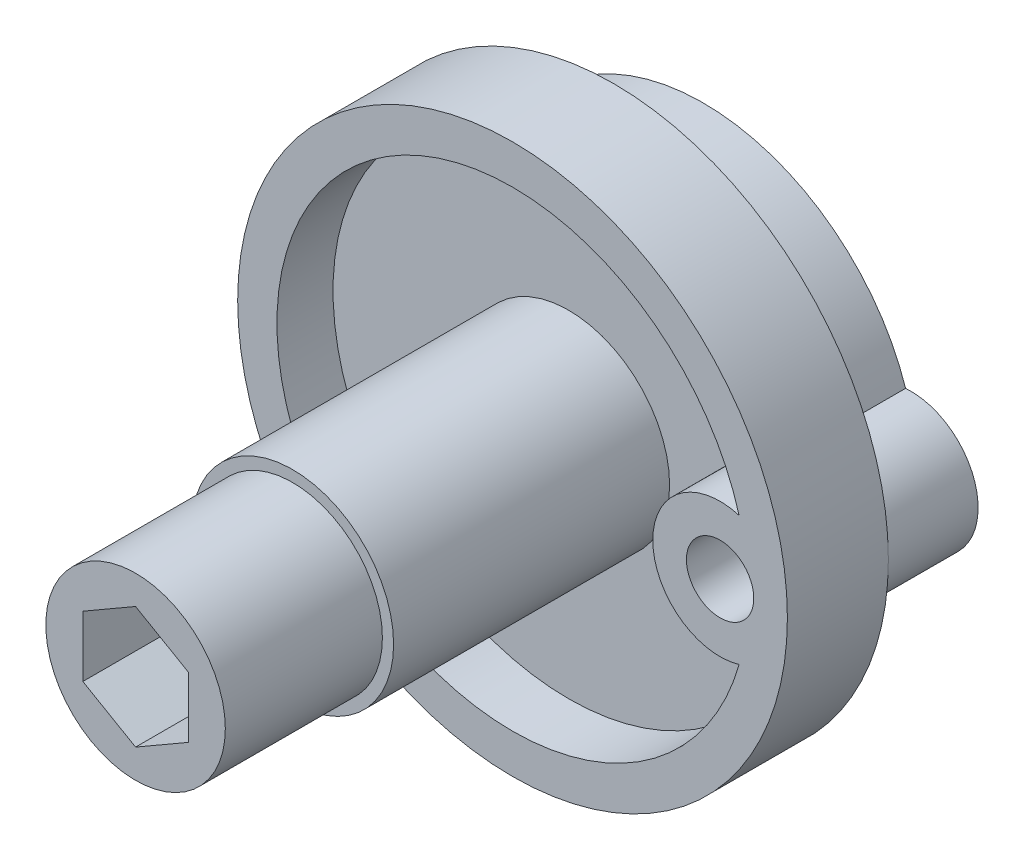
ISO-10303-21;
HEADER;
FILE_DESCRIPTION(('STEP AP214'),'2;1');
FILE_NAME('part.step','',(''),(''),'','','');
FILE_SCHEMA(('AUTOMOTIVE_DESIGN { 1 0 10303 214 1 1 1 1 }'));
ENDSEC;
DATA;
#1=APPLICATION_CONTEXT('core data for automotive mechanical design processes');
#2=APPLICATION_PROTOCOL_DEFINITION('international standard','automotive_design',2000,#1);
#3=PRODUCT_CONTEXT('',#1,'mechanical');
#4=PRODUCT('Part','Part','',(#3));
#5=PRODUCT_RELATED_PRODUCT_CATEGORY('part','',(#4));
#6=PRODUCT_DEFINITION_FORMATION('','',#4);
#7=PRODUCT_DEFINITION_CONTEXT('part definition',#1,'design');
#8=PRODUCT_DEFINITION('design','',#6,#7);
#9=PRODUCT_DEFINITION_SHAPE('','',#8);
#10=(LENGTH_UNIT() NAMED_UNIT(*) SI_UNIT(.MILLI.,.METRE.));
#11=(NAMED_UNIT(*) PLANE_ANGLE_UNIT() SI_UNIT($,.RADIAN.));
#12=(NAMED_UNIT(*) SI_UNIT($,.STERADIAN.) SOLID_ANGLE_UNIT());
#13=UNCERTAINTY_MEASURE_WITH_UNIT(LENGTH_MEASURE(1.E-05),#10,'distance_accuracy_value','');
#14=(GEOMETRIC_REPRESENTATION_CONTEXT(3) GLOBAL_UNCERTAINTY_ASSIGNED_CONTEXT((#13)) GLOBAL_UNIT_ASSIGNED_CONTEXT((#10,
#11,#12)) REPRESENTATION_CONTEXT('',''));
#15=CARTESIAN_POINT('',(0.,0.,0.));
#16=DIRECTION('',(0.,0.,1.));
#17=DIRECTION('',(1.,0.,0.));
#18=AXIS2_PLACEMENT_3D('',#15,#16,#17);
#19=CARTESIAN_POINT('',(0.,0.,0.));
#20=DIRECTION('',(0.,0.,-1.));
#21=DIRECTION('',(-1.,0.,0.));
#22=AXIS2_PLACEMENT_3D('',#19,#20,#21);
#23=PLANE('',#22);
#24=CARTESIAN_POINT('',(0.,0.,0.));
#25=DIRECTION('',(0.,0.,1.));
#26=DIRECTION('',(1.,0.,0.));
#27=AXIS2_PLACEMENT_3D('',#24,#25,#26);
#28=CIRCLE('',#27,4.);
#29=CARTESIAN_POINT('',(3.92905841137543,-0.750000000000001,0.));
#30=VERTEX_POINT('',#29);
#31=CARTESIAN_POINT('',(0.749999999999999,-3.92905841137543,0.));
#32=VERTEX_POINT('',#31);
#33=EDGE_CURVE('E125',#30,#32,#28,.F.);
#34=ORIENTED_EDGE('',*,*,#33,.F.);
#35=DIRECTION('',(1.,0.,0.));
#36=VECTOR('',#35,1.);
#37=CARTESIAN_POINT('',(3.92905841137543,-0.750000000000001,0.));
#38=LINE('',#37,#36);
#39=CARTESIAN_POINT('',(6.34526249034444,-0.750000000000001,0.));
#40=VERTEX_POINT('',#39);
#41=EDGE_CURVE('E103',#40,#30,#38,.F.);
#42=ORIENTED_EDGE('',*,*,#41,.F.);
#43=CARTESIAN_POINT('',(9.25,0.,0.));
#44=DIRECTION('',(0.,0.,-1.));
#45=DIRECTION('',(-1.,0.,0.));
#46=AXIS2_PLACEMENT_3D('',#43,#44,#45);
#47=CIRCLE('',#46,3.);
#48=CARTESIAN_POINT('',(7.59797297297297,-2.50415788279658,0.));
#49=VERTEX_POINT('',#48);
#50=EDGE_CURVE('E20',#49,#40,#47,.T.);
#51=ORIENTED_EDGE('',*,*,#50,.F.);
#52=CARTESIAN_POINT('',(0.,0.,0.));
#53=DIRECTION('',(0.,0.,1.));
#54=DIRECTION('',(1.,0.,0.));
#55=AXIS2_PLACEMENT_3D('',#52,#53,#54);
#56=CIRCLE('',#55,8.);
#57=CARTESIAN_POINT('',(0.749999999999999,-7.964766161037,0.));
#58=VERTEX_POINT('',#57);
#59=EDGE_CURVE('E100',#49,#58,#56,.F.);
#60=ORIENTED_EDGE('',*,*,#59,.T.);
#61=DIRECTION('',(0.,1.,0.));
#62=VECTOR('',#61,1.);
#63=CARTESIAN_POINT('',(0.749999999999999,-7.964766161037,0.));
#64=LINE('',#63,#62);
#65=EDGE_CURVE('E118',#32,#58,#64,.F.);
#66=ORIENTED_EDGE('',*,*,#65,.F.);
#67=EDGE_LOOP('',(#34,#42,#51,#60,#66));
#68=FACE_BOUND('',#67,.T.);
#69=ADVANCED_FACE('F16',(#68),#23,.T.);
#70=CARTESIAN_POINT('',(0.,0.,0.));
#71=DIRECTION('',(0.,0.,-1.));
#72=DIRECTION('',(-1.,0.,0.));
#73=AXIS2_PLACEMENT_3D('',#70,#71,#72);
#74=PLANE('',#73);
#75=DIRECTION('',(0.,1.,0.));
#76=VECTOR('',#75,1.);
#77=CARTESIAN_POINT('',(0.750000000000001,3.92905841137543,0.));
#78=LINE('',#77,#76);
#79=CARTESIAN_POINT('',(0.750000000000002,7.96476616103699,0.));
#80=VERTEX_POINT('',#79);
#81=CARTESIAN_POINT('',(0.750000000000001,3.92905841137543,0.));
#82=VERTEX_POINT('',#81);
#83=EDGE_CURVE('E248',#80,#82,#78,.F.);
#84=ORIENTED_EDGE('',*,*,#83,.F.);
#85=CARTESIAN_POINT('',(0.,0.,0.));
#86=DIRECTION('',(0.,0.,1.));
#87=DIRECTION('',(1.,0.,0.));
#88=AXIS2_PLACEMENT_3D('',#85,#86,#87);
#89=CIRCLE('',#88,8.);
#90=CARTESIAN_POINT('',(7.59797297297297,2.50415788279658,0.));
#91=VERTEX_POINT('',#90);
#92=EDGE_CURVE('E134',#80,#91,#89,.F.);
#93=ORIENTED_EDGE('',*,*,#92,.T.);
#94=CARTESIAN_POINT('',(9.25,0.,0.));
#95=DIRECTION('',(0.,0.,-1.));
#96=DIRECTION('',(-1.,0.,0.));
#97=AXIS2_PLACEMENT_3D('',#94,#95,#96);
#98=CIRCLE('',#97,3.);
#99=CARTESIAN_POINT('',(6.34526249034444,0.75,0.));
#100=VERTEX_POINT('',#99);
#101=EDGE_CURVE('E138',#100,#91,#98,.T.);
#102=ORIENTED_EDGE('',*,*,#101,.F.);
#103=DIRECTION('',(1.,0.,0.));
#104=VECTOR('',#103,1.);
#105=CARTESIAN_POINT('',(7.964766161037,0.75,0.));
#106=LINE('',#105,#104);
#107=CARTESIAN_POINT('',(3.92905841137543,0.75,0.));
#108=VERTEX_POINT('',#107);
#109=EDGE_CURVE('E133',#108,#100,#106,.T.);
#110=ORIENTED_EDGE('',*,*,#109,.F.);
#111=CARTESIAN_POINT('',(0.,0.,0.));
#112=DIRECTION('',(0.,0.,1.));
#113=DIRECTION('',(1.,0.,0.));
#114=AXIS2_PLACEMENT_3D('',#111,#112,#113);
#115=CIRCLE('',#114,4.);
#116=EDGE_CURVE('E129',#82,#108,#115,.F.);
#117=ORIENTED_EDGE('',*,*,#116,.F.);
#118=EDGE_LOOP('',(#84,#93,#102,#110,#117));
#119=FACE_BOUND('',#118,.T.);
#120=ADVANCED_FACE('F414',(#119),#74,.T.);
#121=CARTESIAN_POINT('',(0.,0.,0.));
#122=DIRECTION('',(0.,0.,-1.));
#123=DIRECTION('',(-1.,0.,0.));
#124=AXIS2_PLACEMENT_3D('',#121,#122,#123);
#125=PLANE('',#124);
#126=DIRECTION('',(1.,0.,0.));
#127=VECTOR('',#126,1.);
#128=CARTESIAN_POINT('',(-7.964766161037,-0.749999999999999,0.));
#129=LINE('',#128,#127);
#130=CARTESIAN_POINT('',(-3.92905841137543,-0.749999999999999,0.));
#131=VERTEX_POINT('',#130);
#132=CARTESIAN_POINT('',(-7.964766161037,-0.749999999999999,0.));
#133=VERTEX_POINT('',#132);
#134=EDGE_CURVE('E144',#131,#133,#129,.F.);
#135=ORIENTED_EDGE('',*,*,#134,.F.);
#136=CARTESIAN_POINT('',(0.,0.,0.));
#137=DIRECTION('',(0.,0.,1.));
#138=DIRECTION('',(1.,0.,0.));
#139=AXIS2_PLACEMENT_3D('',#136,#137,#138);
#140=CIRCLE('',#139,4.);
#141=CARTESIAN_POINT('',(-0.75,-3.92905841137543,0.));
#142=VERTEX_POINT('',#141);
#143=EDGE_CURVE('E145',#142,#131,#140,.F.);
#144=ORIENTED_EDGE('',*,*,#143,.F.);
#145=DIRECTION('',(0.,1.,0.));
#146=VECTOR('',#145,1.);
#147=CARTESIAN_POINT('',(-0.75,-3.92905841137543,0.));
#148=LINE('',#147,#146);
#149=CARTESIAN_POINT('',(-0.75,-7.964766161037,0.));
#150=VERTEX_POINT('',#149);
#151=EDGE_CURVE('E255',#150,#142,#148,.T.);
#152=ORIENTED_EDGE('',*,*,#151,.F.);
#153=CARTESIAN_POINT('',(0.,0.,0.));
#154=DIRECTION('',(0.,0.,1.));
#155=DIRECTION('',(1.,0.,0.));
#156=AXIS2_PLACEMENT_3D('',#153,#154,#155);
#157=CIRCLE('',#156,8.);
#158=EDGE_CURVE('E142',#150,#133,#157,.F.);
#159=ORIENTED_EDGE('',*,*,#158,.T.);
#160=EDGE_LOOP('',(#135,#144,#152,#159));
#161=FACE_BOUND('',#160,.T.);
#162=ADVANCED_FACE('F405',(#161),#125,.T.);
#163=CARTESIAN_POINT('',(0.,0.,0.));
#164=DIRECTION('',(0.,0.,-1.));
#165=DIRECTION('',(-1.,0.,0.));
#166=AXIS2_PLACEMENT_3D('',#163,#164,#165);
#167=PLANE('',#166);
#168=DIRECTION('',(1.,0.,0.));
#169=VECTOR('',#168,1.);
#170=CARTESIAN_POINT('',(-3.92905841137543,0.75,0.));
#171=LINE('',#170,#169);
#172=CARTESIAN_POINT('',(-7.964766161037,0.75,0.));
#173=VERTEX_POINT('',#172);
#174=CARTESIAN_POINT('',(-3.92905841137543,0.75,0.));
#175=VERTEX_POINT('',#174);
#176=EDGE_CURVE('E153',#173,#175,#171,.T.);
#177=ORIENTED_EDGE('',*,*,#176,.F.);
#178=CARTESIAN_POINT('',(0.,0.,0.));
#179=DIRECTION('',(0.,0.,1.));
#180=DIRECTION('',(1.,0.,0.));
#181=AXIS2_PLACEMENT_3D('',#178,#179,#180);
#182=CIRCLE('',#181,8.);
#183=CARTESIAN_POINT('',(-0.75,7.964766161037,0.));
#184=VERTEX_POINT('',#183);
#185=EDGE_CURVE('E155',#173,#184,#182,.F.);
#186=ORIENTED_EDGE('',*,*,#185,.T.);
#187=DIRECTION('',(0.,1.,0.));
#188=VECTOR('',#187,1.);
#189=CARTESIAN_POINT('',(-0.75,7.964766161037,0.));
#190=LINE('',#189,#188);
#191=CARTESIAN_POINT('',(-0.75,3.92905841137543,0.));
#192=VERTEX_POINT('',#191);
#193=EDGE_CURVE('E263',#192,#184,#190,.T.);
#194=ORIENTED_EDGE('',*,*,#193,.F.);
#195=CARTESIAN_POINT('',(0.,0.,0.));
#196=DIRECTION('',(0.,0.,1.));
#197=DIRECTION('',(1.,0.,0.));
#198=AXIS2_PLACEMENT_3D('',#195,#196,#197);
#199=CIRCLE('',#198,4.);
#200=EDGE_CURVE('E150',#175,#192,#199,.F.);
#201=ORIENTED_EDGE('',*,*,#200,.F.);
#202=EDGE_LOOP('',(#177,#186,#194,#201));
#203=FACE_BOUND('',#202,.T.);
#204=ADVANCED_FACE('F402',(#203),#167,.T.);
#205=CARTESIAN_POINT('',(9.25,0.,4.5));
#206=DIRECTION('',(0.,0.,-1.));
#207=DIRECTION('',(-1.,0.,0.));
#208=AXIS2_PLACEMENT_3D('',#205,#206,#207);
#209=CYLINDRICAL_SURFACE('',#208,3.);
#210=DIRECTION('',(0.,0.,-1.));
#211=VECTOR('',#210,1.);
#212=CARTESIAN_POINT('',(9.01689189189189,-2.99092972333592,0.));
#213=LINE('',#212,#211);
#214=CARTESIAN_POINT('',(9.01689189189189,-2.99092972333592,-4.));
#215=VERTEX_POINT('',#214);
#216=CARTESIAN_POINT('',(9.01689189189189,-2.99092972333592,0.));
#217=VERTEX_POINT('',#216);
#218=EDGE_CURVE('E107',#215,#217,#213,.F.);
#219=ORIENTED_EDGE('',*,*,#218,.F.);
#220=CARTESIAN_POINT('',(9.25,0.,-4.));
#221=DIRECTION('',(0.,0.,-1.));
#222=DIRECTION('',(-1.,0.,0.));
#223=AXIS2_PLACEMENT_3D('',#220,#221,#222);
#224=CIRCLE('',#223,3.);
#225=CARTESIAN_POINT('',(9.01689189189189,2.99092972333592,-4.));
#226=VERTEX_POINT('',#225);
#227=EDGE_CURVE('E166',#215,#226,#224,.F.);
#228=ORIENTED_EDGE('',*,*,#227,.T.);
#229=DIRECTION('',(0.,0.,-1.));
#230=VECTOR('',#229,1.);
#231=CARTESIAN_POINT('',(9.01689189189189,2.99092972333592,0.));
#232=LINE('',#231,#230);
#233=CARTESIAN_POINT('',(9.01689189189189,2.99092972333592,0.));
#234=VERTEX_POINT('',#233);
#235=EDGE_CURVE('E268',#234,#226,#232,.T.);
#236=ORIENTED_EDGE('',*,*,#235,.F.);
#237=CARTESIAN_POINT('',(9.25,0.,0.));
#238=DIRECTION('',(0.,0.,-1.));
#239=DIRECTION('',(-1.,0.,0.));
#240=AXIS2_PLACEMENT_3D('',#237,#238,#239);
#241=CIRCLE('',#240,3.);
#242=CARTESIAN_POINT('',(12.25,0.,0.));
#243=VERTEX_POINT('',#242);
#244=EDGE_CURVE('E35',#243,#234,#241,.F.);
#245=ORIENTED_EDGE('',*,*,#244,.F.);
#246=CARTESIAN_POINT('',(9.25,0.,0.));
#247=DIRECTION('',(0.,0.,-1.));
#248=DIRECTION('',(-1.,0.,0.));
#249=AXIS2_PLACEMENT_3D('',#246,#247,#248);
#250=CIRCLE('',#249,3.);
#251=EDGE_CURVE('E163',#217,#243,#250,.F.);
#252=ORIENTED_EDGE('',*,*,#251,.F.);
#253=EDGE_LOOP('',(#219,#228,#236,#245,#252));
#254=FACE_BOUND('',#253,.T.);
#255=ADVANCED_FACE('F404',(#254),#209,.T.);
#256=CARTESIAN_POINT('',(0.,0.,0.));
#257=DIRECTION('',(0.,0.,-1.));
#258=DIRECTION('',(-1.,0.,0.));
#259=AXIS2_PLACEMENT_3D('',#256,#257,#258);
#260=CYLINDRICAL_SURFACE('',#259,9.5);
#261=ORIENTED_EDGE('',*,*,#218,.T.);
#262=CARTESIAN_POINT('',(0.,0.,0.));
#263=DIRECTION('',(0.,0.,-1.));
#264=DIRECTION('',(-1.,0.,0.));
#265=AXIS2_PLACEMENT_3D('',#262,#263,#264);
#266=CIRCLE('',#265,9.5);
#267=EDGE_CURVE('E160',#234,#217,#266,.F.);
#268=ORIENTED_EDGE('',*,*,#267,.F.);
#269=ORIENTED_EDGE('',*,*,#235,.T.);
#270=CARTESIAN_POINT('',(0.,0.,-4.));
#271=DIRECTION('',(0.,0.,-1.));
#272=DIRECTION('',(-1.,0.,0.));
#273=AXIS2_PLACEMENT_3D('',#270,#271,#272);
#274=CIRCLE('',#273,9.5);
#275=EDGE_CURVE('E169',#226,#215,#274,.F.);
#276=ORIENTED_EDGE('',*,*,#275,.T.);
#277=EDGE_LOOP('',(#261,#268,#269,#276));
#278=FACE_BOUND('',#277,.T.);
#279=ADVANCED_FACE('F412',(#278),#260,.T.);
#280=CARTESIAN_POINT('',(9.25,0.,4.5));
#281=DIRECTION('',(0.,0.,-1.));
#282=DIRECTION('',(-1.,0.,0.));
#283=AXIS2_PLACEMENT_3D('',#280,#281,#282);
#284=CYLINDRICAL_SURFACE('',#283,3.);
#285=DIRECTION('',(0.,0.,1.));
#286=VECTOR('',#285,1.);
#287=CARTESIAN_POINT('',(7.59797297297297,-2.50415788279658,-4.));
#288=LINE('',#287,#286);
#289=CARTESIAN_POINT('',(7.59797297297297,-2.50415788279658,-4.));
#290=VERTEX_POINT('',#289);
#291=EDGE_CURVE('E110',#290,#49,#288,.T.);
#292=ORIENTED_EDGE('',*,*,#291,.T.);
#293=ORIENTED_EDGE('',*,*,#50,.T.);
#294=DIRECTION('',(0.,0.,-1.));
#295=VECTOR('',#294,1.);
#296=CARTESIAN_POINT('',(6.34526249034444,-0.750000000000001,0.));
#297=LINE('',#296,#295);
#298=CARTESIAN_POINT('',(6.34526249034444,-0.750000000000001,-4.));
#299=VERTEX_POINT('',#298);
#300=EDGE_CURVE('E247',#299,#40,#297,.F.);
#301=ORIENTED_EDGE('',*,*,#300,.F.);
#302=CARTESIAN_POINT('',(9.25,0.,-4.));
#303=DIRECTION('',(0.,0.,-1.));
#304=DIRECTION('',(-1.,0.,0.));
#305=AXIS2_PLACEMENT_3D('',#302,#303,#304);
#306=CIRCLE('',#305,3.);
#307=EDGE_CURVE('E114',#299,#290,#306,.F.);
#308=ORIENTED_EDGE('',*,*,#307,.T.);
#309=EDGE_LOOP('',(#292,#293,#301,#308));
#310=FACE_BOUND('',#309,.T.);
#311=ADVANCED_FACE('F111',(#310),#284,.T.);
#312=CARTESIAN_POINT('',(0.,0.,-4.));
#313=DIRECTION('',(0.,0.,1.));
#314=DIRECTION('',(1.,0.,0.));
#315=AXIS2_PLACEMENT_3D('',#312,#313,#314);
#316=CYLINDRICAL_SURFACE('',#315,8.);
#317=CARTESIAN_POINT('',(0.,0.,-4.));
#318=DIRECTION('',(0.,0.,1.));
#319=DIRECTION('',(1.,0.,0.));
#320=AXIS2_PLACEMENT_3D('',#317,#318,#319);
#321=CIRCLE('',#320,8.);
#322=CARTESIAN_POINT('',(0.749999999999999,-7.964766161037,-4.));
#323=VERTEX_POINT('',#322);
#324=EDGE_CURVE('E173',#290,#323,#321,.F.);
#325=ORIENTED_EDGE('',*,*,#324,.T.);
#326=DIRECTION('',(0.,0.,-1.));
#327=VECTOR('',#326,1.);
#328=CARTESIAN_POINT('',(0.749999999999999,-7.964766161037,0.));
#329=LINE('',#328,#327);
#330=EDGE_CURVE('E122',#58,#323,#329,.T.);
#331=ORIENTED_EDGE('',*,*,#330,.F.);
#332=ORIENTED_EDGE('',*,*,#59,.F.);
#333=ORIENTED_EDGE('',*,*,#291,.F.);
#334=EDGE_LOOP('',(#325,#331,#332,#333));
#335=FACE_BOUND('',#334,.T.);
#336=ADVANCED_FACE('F120',(#335),#316,.F.);
#337=CARTESIAN_POINT('',(0.749999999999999,-7.964766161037,0.));
#338=DIRECTION('',(1.,0.,0.));
#339=DIRECTION('',(0.,0.,-1.));
#340=AXIS2_PLACEMENT_3D('',#337,#338,#339);
#341=PLANE('',#340);
#342=ORIENTED_EDGE('',*,*,#65,.T.);
#343=ORIENTED_EDGE('',*,*,#330,.T.);
#344=DIRECTION('',(0.,1.,0.));
#345=VECTOR('',#344,1.);
#346=CARTESIAN_POINT('',(0.749999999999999,0.,-4.));
#347=LINE('',#346,#345);
#348=CARTESIAN_POINT('',(0.749999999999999,-3.92905841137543,-4.));
#349=VERTEX_POINT('',#348);
#350=EDGE_CURVE('E175',#323,#349,#347,.T.);
#351=ORIENTED_EDGE('',*,*,#350,.T.);
#352=DIRECTION('',(0.,0.,1.));
#353=VECTOR('',#352,1.);
#354=CARTESIAN_POINT('',(0.75,-3.92905841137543,-4.));
#355=LINE('',#354,#353);
#356=EDGE_CURVE('E128',#32,#349,#355,.F.);
#357=ORIENTED_EDGE('',*,*,#356,.F.);
#358=EDGE_LOOP('',(#342,#343,#351,#357));
#359=FACE_BOUND('',#358,.T.);
#360=ADVANCED_FACE('F731',(#359),#341,.T.);
#361=CARTESIAN_POINT('',(0.,0.,-4.));
#362=DIRECTION('',(0.,0.,1.));
#363=DIRECTION('',(1.,0.,0.));
#364=AXIS2_PLACEMENT_3D('',#361,#362,#363);
#365=CYLINDRICAL_SURFACE('',#364,4.);
#366=ORIENTED_EDGE('',*,*,#356,.T.);
#367=CARTESIAN_POINT('',(0.,0.,-4.));
#368=DIRECTION('',(0.,0.,1.));
#369=DIRECTION('',(1.,0.,0.));
#370=AXIS2_PLACEMENT_3D('',#367,#368,#369);
#371=CIRCLE('',#370,4.);
#372=CARTESIAN_POINT('',(3.92905841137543,-0.750000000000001,-4.));
#373=VERTEX_POINT('',#372);
#374=EDGE_CURVE('E176',#349,#373,#371,.T.);
#375=ORIENTED_EDGE('',*,*,#374,.T.);
#376=DIRECTION('',(0.,0.,-1.));
#377=VECTOR('',#376,1.);
#378=CARTESIAN_POINT('',(3.92905841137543,-0.750000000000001,0.));
#379=LINE('',#378,#377);
#380=EDGE_CURVE('E246',#30,#373,#379,.T.);
#381=ORIENTED_EDGE('',*,*,#380,.F.);
#382=ORIENTED_EDGE('',*,*,#33,.T.);
#383=EDGE_LOOP('',(#366,#375,#381,#382));
#384=FACE_BOUND('',#383,.T.);
#385=ADVANCED_FACE('F723',(#384),#365,.T.);
#386=CARTESIAN_POINT('',(3.92905841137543,-0.750000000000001,0.));
#387=DIRECTION('',(0.,-1.,0.));
#388=DIRECTION('',(0.,0.,-1.));
#389=AXIS2_PLACEMENT_3D('',#386,#387,#388);
#390=PLANE('',#389);
#391=ORIENTED_EDGE('',*,*,#380,.T.);
#392=DIRECTION('',(1.,0.,0.));
#393=VECTOR('',#392,1.);
#394=CARTESIAN_POINT('',(0.,-0.750000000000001,-4.));
#395=LINE('',#394,#393);
#396=EDGE_CURVE('E179',#373,#299,#395,.T.);
#397=ORIENTED_EDGE('',*,*,#396,.T.);
#398=ORIENTED_EDGE('',*,*,#300,.T.);
#399=ORIENTED_EDGE('',*,*,#41,.T.);
#400=EDGE_LOOP('',(#391,#397,#398,#399));
#401=FACE_BOUND('',#400,.T.);
#402=ADVANCED_FACE('F715',(#401),#390,.T.);
#403=CARTESIAN_POINT('',(7.964766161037,0.75,0.));
#404=DIRECTION('',(0.,1.,0.));
#405=DIRECTION('',(0.,0.,1.));
#406=AXIS2_PLACEMENT_3D('',#403,#404,#405);
#407=PLANE('',#406);
#408=DIRECTION('',(0.,0.,1.));
#409=VECTOR('',#408,1.);
#410=CARTESIAN_POINT('',(3.92905841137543,0.75,-4.));
#411=LINE('',#410,#409);
#412=CARTESIAN_POINT('',(3.92905841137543,0.75,-4.));
#413=VERTEX_POINT('',#412);
#414=EDGE_CURVE('E132',#108,#413,#411,.F.);
#415=ORIENTED_EDGE('',*,*,#414,.F.);
#416=ORIENTED_EDGE('',*,*,#109,.T.);
#417=DIRECTION('',(0.,0.,-1.));
#418=VECTOR('',#417,1.);
#419=CARTESIAN_POINT('',(6.34526249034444,0.750000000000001,4.5));
#420=LINE('',#419,#418);
#421=CARTESIAN_POINT('',(6.34526249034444,0.75,-4.));
#422=VERTEX_POINT('',#421);
#423=EDGE_CURVE('E136',#422,#100,#420,.F.);
#424=ORIENTED_EDGE('',*,*,#423,.F.);
#425=DIRECTION('',(1.,0.,0.));
#426=VECTOR('',#425,1.);
#427=CARTESIAN_POINT('',(0.,0.75,-4.));
#428=LINE('',#427,#426);
#429=EDGE_CURVE('E184',#422,#413,#428,.F.);
#430=ORIENTED_EDGE('',*,*,#429,.T.);
#431=EDGE_LOOP('',(#415,#416,#424,#430));
#432=FACE_BOUND('',#431,.T.);
#433=ADVANCED_FACE('F707',(#432),#407,.T.);
#434=CARTESIAN_POINT('',(0.,0.,-4.));
#435=DIRECTION('',(0.,0.,1.));
#436=DIRECTION('',(1.,0.,0.));
#437=AXIS2_PLACEMENT_3D('',#434,#435,#436);
#438=CYLINDRICAL_SURFACE('',#437,4.);
#439=ORIENTED_EDGE('',*,*,#414,.T.);
#440=CARTESIAN_POINT('',(0.,0.,-4.));
#441=DIRECTION('',(0.,0.,1.));
#442=DIRECTION('',(1.,0.,0.));
#443=AXIS2_PLACEMENT_3D('',#440,#441,#442);
#444=CIRCLE('',#443,4.);
#445=CARTESIAN_POINT('',(0.750000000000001,3.92905841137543,-4.));
#446=VERTEX_POINT('',#445);
#447=EDGE_CURVE('E180',#413,#446,#444,.T.);
#448=ORIENTED_EDGE('',*,*,#447,.T.);
#449=DIRECTION('',(0.,0.,-1.));
#450=VECTOR('',#449,1.);
#451=CARTESIAN_POINT('',(0.750000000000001,3.92905841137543,0.));
#452=LINE('',#451,#450);
#453=EDGE_CURVE('E251',#82,#446,#452,.T.);
#454=ORIENTED_EDGE('',*,*,#453,.F.);
#455=ORIENTED_EDGE('',*,*,#116,.T.);
#456=EDGE_LOOP('',(#439,#448,#454,#455));
#457=FACE_BOUND('',#456,.T.);
#458=ADVANCED_FACE('F699',(#457),#438,.T.);
#459=CARTESIAN_POINT('',(0.750000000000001,3.92905841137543,0.));
#460=DIRECTION('',(1.,0.,0.));
#461=DIRECTION('',(0.,0.,-1.));
#462=AXIS2_PLACEMENT_3D('',#459,#460,#461);
#463=PLANE('',#462);
#464=ORIENTED_EDGE('',*,*,#83,.T.);
#465=ORIENTED_EDGE('',*,*,#453,.T.);
#466=DIRECTION('',(0.,1.,0.));
#467=VECTOR('',#466,1.);
#468=CARTESIAN_POINT('',(0.750000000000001,0.,-4.));
#469=LINE('',#468,#467);
#470=CARTESIAN_POINT('',(0.750000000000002,7.96476616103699,-4.));
#471=VERTEX_POINT('',#470);
#472=EDGE_CURVE('E183',#446,#471,#469,.T.);
#473=ORIENTED_EDGE('',*,*,#472,.T.);
#474=DIRECTION('',(0.,0.,1.));
#475=VECTOR('',#474,1.);
#476=CARTESIAN_POINT('',(0.750000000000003,7.964766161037,-4.));
#477=LINE('',#476,#475);
#478=EDGE_CURVE('E137',#471,#80,#477,.T.);
#479=ORIENTED_EDGE('',*,*,#478,.T.);
#480=EDGE_LOOP('',(#464,#465,#473,#479));
#481=FACE_BOUND('',#480,.T.);
#482=ADVANCED_FACE('F691',(#481),#463,.T.);
#483=CARTESIAN_POINT('',(0.,0.,-4.));
#484=DIRECTION('',(0.,0.,1.));
#485=DIRECTION('',(1.,0.,0.));
#486=AXIS2_PLACEMENT_3D('',#483,#484,#485);
#487=CYLINDRICAL_SURFACE('',#486,8.);
#488=ORIENTED_EDGE('',*,*,#92,.F.);
#489=ORIENTED_EDGE('',*,*,#478,.F.);
#490=CARTESIAN_POINT('',(0.,0.,-4.));
#491=DIRECTION('',(0.,0.,1.));
#492=DIRECTION('',(1.,0.,0.));
#493=AXIS2_PLACEMENT_3D('',#490,#491,#492);
#494=CIRCLE('',#493,8.);
#495=CARTESIAN_POINT('',(7.59797297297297,2.50415788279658,-4.));
#496=VERTEX_POINT('',#495);
#497=EDGE_CURVE('E185',#471,#496,#494,.F.);
#498=ORIENTED_EDGE('',*,*,#497,.T.);
#499=DIRECTION('',(0.,0.,-1.));
#500=VECTOR('',#499,1.);
#501=CARTESIAN_POINT('',(7.59797297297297,2.50415788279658,4.5));
#502=LINE('',#501,#500);
#503=EDGE_CURVE('E141',#91,#496,#502,.T.);
#504=ORIENTED_EDGE('',*,*,#503,.F.);
#505=EDGE_LOOP('',(#488,#489,#498,#504));
#506=FACE_BOUND('',#505,.T.);
#507=ADVANCED_FACE('F683',(#506),#487,.F.);
#508=CARTESIAN_POINT('',(9.25,0.,4.5));
#509=DIRECTION('',(0.,0.,-1.));
#510=DIRECTION('',(-1.,0.,0.));
#511=AXIS2_PLACEMENT_3D('',#508,#509,#510);
#512=CYLINDRICAL_SURFACE('',#511,3.);
#513=ORIENTED_EDGE('',*,*,#503,.T.);
#514=CARTESIAN_POINT('',(9.25,0.,-4.));
#515=DIRECTION('',(0.,0.,-1.));
#516=DIRECTION('',(-1.,0.,0.));
#517=AXIS2_PLACEMENT_3D('',#514,#515,#516);
#518=CIRCLE('',#517,3.);
#519=EDGE_CURVE('E188',#496,#422,#518,.F.);
#520=ORIENTED_EDGE('',*,*,#519,.T.);
#521=ORIENTED_EDGE('',*,*,#423,.T.);
#522=ORIENTED_EDGE('',*,*,#101,.T.);
#523=EDGE_LOOP('',(#513,#520,#521,#522));
#524=FACE_BOUND('',#523,.T.);
#525=ADVANCED_FACE('F675',(#524),#512,.T.);
#526=CARTESIAN_POINT('',(0.,0.,-4.));
#527=DIRECTION('',(0.,0.,1.));
#528=DIRECTION('',(1.,0.,0.));
#529=AXIS2_PLACEMENT_3D('',#526,#527,#528);
#530=CYLINDRICAL_SURFACE('',#529,8.);
#531=CARTESIAN_POINT('',(0.,0.,-4.));
#532=DIRECTION('',(0.,0.,1.));
#533=DIRECTION('',(1.,0.,0.));
#534=AXIS2_PLACEMENT_3D('',#531,#532,#533);
#535=CIRCLE('',#534,8.);
#536=CARTESIAN_POINT('',(-0.75,-7.964766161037,-4.));
#537=VERTEX_POINT('',#536);
#538=CARTESIAN_POINT('',(-7.964766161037,-0.749999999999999,-4.));
#539=VERTEX_POINT('',#538);
#540=EDGE_CURVE('E191',#537,#539,#535,.F.);
#541=ORIENTED_EDGE('',*,*,#540,.T.);
#542=DIRECTION('',(0.,0.,-1.));
#543=VECTOR('',#542,1.);
#544=CARTESIAN_POINT('',(-7.964766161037,-0.749999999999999,0.));
#545=LINE('',#544,#543);
#546=EDGE_CURVE('E149',#133,#539,#545,.T.);
#547=ORIENTED_EDGE('',*,*,#546,.F.);
#548=ORIENTED_EDGE('',*,*,#158,.F.);
#549=DIRECTION('',(0.,0.,1.));
#550=VECTOR('',#549,1.);
#551=CARTESIAN_POINT('',(-0.75,-7.964766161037,0.));
#552=LINE('',#551,#550);
#553=EDGE_CURVE('E259',#537,#150,#552,.T.);
#554=ORIENTED_EDGE('',*,*,#553,.F.);
#555=EDGE_LOOP('',(#541,#547,#548,#554));
#556=FACE_BOUND('',#555,.T.);
#557=ADVANCED_FACE('F667',(#556),#530,.F.);
#558=CARTESIAN_POINT('',(-7.964766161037,-0.749999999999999,0.));
#559=DIRECTION('',(0.,-1.,0.));
#560=DIRECTION('',(0.,0.,-1.));
#561=AXIS2_PLACEMENT_3D('',#558,#559,#560);
#562=PLANE('',#561);
#563=ORIENTED_EDGE('',*,*,#134,.T.);
#564=ORIENTED_EDGE('',*,*,#546,.T.);
#565=DIRECTION('',(1.,0.,0.));
#566=VECTOR('',#565,1.);
#567=CARTESIAN_POINT('',(0.,-0.749999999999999,-4.));
#568=LINE('',#567,#566);
#569=CARTESIAN_POINT('',(-3.92905841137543,-0.749999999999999,-4.));
#570=VERTEX_POINT('',#569);
#571=EDGE_CURVE('E194',#539,#570,#568,.T.);
#572=ORIENTED_EDGE('',*,*,#571,.T.);
#573=DIRECTION('',(0.,0.,1.));
#574=VECTOR('',#573,1.);
#575=CARTESIAN_POINT('',(-3.92905841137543,-0.749999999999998,-4.));
#576=LINE('',#575,#574);
#577=EDGE_CURVE('E148',#131,#570,#576,.F.);
#578=ORIENTED_EDGE('',*,*,#577,.F.);
#579=EDGE_LOOP('',(#563,#564,#572,#578));
#580=FACE_BOUND('',#579,.T.);
#581=ADVANCED_FACE('F659',(#580),#562,.T.);
#582=CARTESIAN_POINT('',(0.,0.,-4.));
#583=DIRECTION('',(0.,0.,1.));
#584=DIRECTION('',(1.,0.,0.));
#585=AXIS2_PLACEMENT_3D('',#582,#583,#584);
#586=CYLINDRICAL_SURFACE('',#585,4.);
#587=ORIENTED_EDGE('',*,*,#577,.T.);
#588=CARTESIAN_POINT('',(0.,0.,-4.));
#589=DIRECTION('',(0.,0.,1.));
#590=DIRECTION('',(1.,0.,0.));
#591=AXIS2_PLACEMENT_3D('',#588,#589,#590);
#592=CIRCLE('',#591,4.);
#593=CARTESIAN_POINT('',(-0.75,-3.92905841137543,-4.));
#594=VERTEX_POINT('',#593);
#595=EDGE_CURVE('E195',#570,#594,#592,.T.);
#596=ORIENTED_EDGE('',*,*,#595,.T.);
#597=DIRECTION('',(0.,0.,1.));
#598=VECTOR('',#597,1.);
#599=CARTESIAN_POINT('',(-0.75,-3.92905841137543,0.));
#600=LINE('',#599,#598);
#601=EDGE_CURVE('E258',#142,#594,#600,.F.);
#602=ORIENTED_EDGE('',*,*,#601,.F.);
#603=ORIENTED_EDGE('',*,*,#143,.T.);
#604=EDGE_LOOP('',(#587,#596,#602,#603));
#605=FACE_BOUND('',#604,.T.);
#606=ADVANCED_FACE('F651',(#605),#586,.T.);
#607=CARTESIAN_POINT('',(-0.75,-3.92905841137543,0.));
#608=DIRECTION('',(-1.,0.,0.));
#609=DIRECTION('',(0.,0.,1.));
#610=AXIS2_PLACEMENT_3D('',#607,#608,#609);
#611=PLANE('',#610);
#612=ORIENTED_EDGE('',*,*,#151,.T.);
#613=ORIENTED_EDGE('',*,*,#601,.T.);
#614=DIRECTION('',(0.,1.,0.));
#615=VECTOR('',#614,1.);
#616=CARTESIAN_POINT('',(-0.75,0.,-4.));
#617=LINE('',#616,#615);
#618=EDGE_CURVE('E198',#594,#537,#617,.F.);
#619=ORIENTED_EDGE('',*,*,#618,.T.);
#620=ORIENTED_EDGE('',*,*,#553,.T.);
#621=EDGE_LOOP('',(#612,#613,#619,#620));
#622=FACE_BOUND('',#621,.T.);
#623=ADVANCED_FACE('F644',(#622),#611,.T.);
#624=CARTESIAN_POINT('',(-0.75,7.964766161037,0.));
#625=DIRECTION('',(-1.,0.,0.));
#626=DIRECTION('',(0.,0.,1.));
#627=AXIS2_PLACEMENT_3D('',#624,#625,#626);
#628=PLANE('',#627);
#629=ORIENTED_EDGE('',*,*,#193,.T.);
#630=DIRECTION('',(0.,0.,1.));
#631=VECTOR('',#630,1.);
#632=CARTESIAN_POINT('',(-0.75,7.964766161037,-4.));
#633=LINE('',#632,#631);
#634=CARTESIAN_POINT('',(-0.75,7.964766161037,-4.));
#635=VERTEX_POINT('',#634);
#636=EDGE_CURVE('E157',#184,#635,#633,.F.);
#637=ORIENTED_EDGE('',*,*,#636,.T.);
#638=DIRECTION('',(0.,1.,0.));
#639=VECTOR('',#638,1.);
#640=CARTESIAN_POINT('',(-0.75,0.,-4.));
#641=LINE('',#640,#639);
#642=CARTESIAN_POINT('',(-0.75,3.92905841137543,-4.));
#643=VERTEX_POINT('',#642);
#644=EDGE_CURVE('E203',#635,#643,#641,.F.);
#645=ORIENTED_EDGE('',*,*,#644,.T.);
#646=DIRECTION('',(0.,0.,1.));
#647=VECTOR('',#646,1.);
#648=CARTESIAN_POINT('',(-0.749999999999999,3.92905841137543,-4.));
#649=LINE('',#648,#647);
#650=EDGE_CURVE('E154',#192,#643,#649,.F.);
#651=ORIENTED_EDGE('',*,*,#650,.F.);
#652=EDGE_LOOP('',(#629,#637,#645,#651));
#653=FACE_BOUND('',#652,.T.);
#654=ADVANCED_FACE('F397',(#653),#628,.T.);
#655=CARTESIAN_POINT('',(0.,0.,-4.));
#656=DIRECTION('',(0.,0.,1.));
#657=DIRECTION('',(1.,0.,0.));
#658=AXIS2_PLACEMENT_3D('',#655,#656,#657);
#659=CYLINDRICAL_SURFACE('',#658,4.);
#660=DIRECTION('',(0.,0.,1.));
#661=VECTOR('',#660,1.);
#662=CARTESIAN_POINT('',(-3.92905841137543,0.75,0.));
#663=LINE('',#662,#661);
#664=CARTESIAN_POINT('',(-3.92905841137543,0.75,-4.));
#665=VERTEX_POINT('',#664);
#666=EDGE_CURVE('E262',#175,#665,#663,.F.);
#667=ORIENTED_EDGE('',*,*,#666,.F.);
#668=ORIENTED_EDGE('',*,*,#200,.T.);
#669=ORIENTED_EDGE('',*,*,#650,.T.);
#670=CARTESIAN_POINT('',(0.,0.,-4.));
#671=DIRECTION('',(0.,0.,1.));
#672=DIRECTION('',(1.,0.,0.));
#673=AXIS2_PLACEMENT_3D('',#670,#671,#672);
#674=CIRCLE('',#673,4.);
#675=EDGE_CURVE('E199',#643,#665,#674,.T.);
#676=ORIENTED_EDGE('',*,*,#675,.T.);
#677=EDGE_LOOP('',(#667,#668,#669,#676));
#678=FACE_BOUND('',#677,.T.);
#679=ADVANCED_FACE('F400',(#678),#659,.T.);
#680=CARTESIAN_POINT('',(-3.92905841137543,0.75,0.));
#681=DIRECTION('',(0.,1.,0.));
#682=DIRECTION('',(0.,0.,1.));
#683=AXIS2_PLACEMENT_3D('',#680,#681,#682);
#684=PLANE('',#683);
#685=ORIENTED_EDGE('',*,*,#176,.T.);
#686=ORIENTED_EDGE('',*,*,#666,.T.);
#687=DIRECTION('',(1.,0.,0.));
#688=VECTOR('',#687,1.);
#689=CARTESIAN_POINT('',(0.,0.75,-4.));
#690=LINE('',#689,#688);
#691=CARTESIAN_POINT('',(-7.964766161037,0.75,-4.));
#692=VERTEX_POINT('',#691);
#693=EDGE_CURVE('E202',#665,#692,#690,.F.);
#694=ORIENTED_EDGE('',*,*,#693,.T.);
#695=DIRECTION('',(0.,0.,1.));
#696=VECTOR('',#695,1.);
#697=CARTESIAN_POINT('',(-7.964766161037,0.749999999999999,-4.));
#698=LINE('',#697,#696);
#699=EDGE_CURVE('E158',#692,#173,#698,.T.);
#700=ORIENTED_EDGE('',*,*,#699,.T.);
#701=EDGE_LOOP('',(#685,#686,#694,#700));
#702=FACE_BOUND('',#701,.T.);
#703=ADVANCED_FACE('F376',(#702),#684,.T.);
#704=CARTESIAN_POINT('',(0.,0.,-4.));
#705=DIRECTION('',(0.,0.,1.));
#706=DIRECTION('',(1.,0.,0.));
#707=AXIS2_PLACEMENT_3D('',#704,#705,#706);
#708=CYLINDRICAL_SURFACE('',#707,8.);
#709=ORIENTED_EDGE('',*,*,#185,.F.);
#710=ORIENTED_EDGE('',*,*,#699,.F.);
#711=CARTESIAN_POINT('',(0.,0.,-4.));
#712=DIRECTION('',(0.,0.,1.));
#713=DIRECTION('',(1.,0.,0.));
#714=AXIS2_PLACEMENT_3D('',#711,#712,#713);
#715=CIRCLE('',#714,8.);
#716=EDGE_CURVE('E204',#692,#635,#715,.F.);
#717=ORIENTED_EDGE('',*,*,#716,.T.);
#718=ORIENTED_EDGE('',*,*,#636,.F.);
#719=EDGE_LOOP('',(#709,#710,#717,#718));
#720=FACE_BOUND('',#719,.T.);
#721=ADVANCED_FACE('F386',(#720),#708,.F.);
#722=CARTESIAN_POINT('',(0.,0.,0.));
#723=DIRECTION('',(0.,0.,-1.));
#724=DIRECTION('',(-1.,0.,0.));
#725=AXIS2_PLACEMENT_3D('',#722,#723,#724);
#726=PLANE('',#725);
#727=ORIENTED_EDGE('',*,*,#251,.T.);
#728=CARTESIAN_POINT('',(0.,0.,0.));
#729=DIRECTION('',(0.,0.,1.));
#730=DIRECTION('',(1.,0.,0.));
#731=AXIS2_PLACEMENT_3D('',#728,#729,#730);
#732=CIRCLE('',#731,12.25);
#733=EDGE_CURVE('E207',#243,#243,#732,.T.);
#734=ORIENTED_EDGE('',*,*,#733,.F.);
#735=ORIENTED_EDGE('',*,*,#244,.T.);
#736=ORIENTED_EDGE('',*,*,#267,.T.);
#737=EDGE_LOOP('',(#727,#734,#735,#736));
#738=FACE_BOUND('',#737,.T.);
#739=ADVANCED_FACE('F492',(#738),#726,.T.);
#740=CARTESIAN_POINT('',(0.,0.,-4.));
#741=DIRECTION('',(0.,0.,1.));
#742=DIRECTION('',(1.,0.,0.));
#743=AXIS2_PLACEMENT_3D('',#740,#741,#742);
#744=PLANE('',#743);
#745=ORIENTED_EDGE('',*,*,#693,.F.);
#746=ORIENTED_EDGE('',*,*,#675,.F.);
#747=ORIENTED_EDGE('',*,*,#644,.F.);
#748=ORIENTED_EDGE('',*,*,#716,.F.);
#749=EDGE_LOOP('',(#745,#746,#747,#748));
#750=FACE_BOUND('',#749,.T.);
#751=ORIENTED_EDGE('',*,*,#595,.F.);
#752=ORIENTED_EDGE('',*,*,#571,.F.);
#753=ORIENTED_EDGE('',*,*,#540,.F.);
#754=ORIENTED_EDGE('',*,*,#618,.F.);
#755=EDGE_LOOP('',(#751,#752,#753,#754));
#756=FACE_BOUND('',#755,.T.);
#757=DIRECTION('',(-0.866025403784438,-0.5,0.));
#758=VECTOR('',#757,1.);
#759=CARTESIAN_POINT('',(0.,2.71354626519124,-4.));
#760=LINE('',#759,#758);
#761=CARTESIAN_POINT('',(0.,2.71354626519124,-4.));
#762=VERTEX_POINT('',#761);
#763=CARTESIAN_POINT('',(-2.35,1.35677313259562,-4.));
#764=VERTEX_POINT('',#763);
#765=EDGE_CURVE('E347',#762,#764,#760,.T.);
#766=ORIENTED_EDGE('',*,*,#765,.T.);
#767=DIRECTION('',(0.,1.,0.));
#768=VECTOR('',#767,1.);
#769=CARTESIAN_POINT('',(-2.35,1.35677313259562,-4.));
#770=LINE('',#769,#768);
#771=CARTESIAN_POINT('',(-2.35,-1.35677313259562,-4.));
#772=VERTEX_POINT('',#771);
#773=EDGE_CURVE('E341',#764,#772,#770,.F.);
#774=ORIENTED_EDGE('',*,*,#773,.T.);
#775=DIRECTION('',(0.866025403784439,-0.5,0.));
#776=VECTOR('',#775,1.);
#777=CARTESIAN_POINT('',(-2.35,-1.35677313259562,-4.00000000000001));
#778=LINE('',#777,#776);
#779=CARTESIAN_POINT('',(0.,-2.71354626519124,-4.));
#780=VERTEX_POINT('',#779);
#781=EDGE_CURVE('E335',#772,#780,#778,.T.);
#782=ORIENTED_EDGE('',*,*,#781,.T.);
#783=DIRECTION('',(0.866025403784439,0.5,0.));
#784=VECTOR('',#783,1.);
#785=CARTESIAN_POINT('',(0.,-2.71354626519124,-4.00000000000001));
#786=LINE('',#785,#784);
#787=CARTESIAN_POINT('',(2.35,-1.35677313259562,-4.));
#788=VERTEX_POINT('',#787);
#789=EDGE_CURVE('E327',#780,#788,#786,.T.);
#790=ORIENTED_EDGE('',*,*,#789,.T.);
#791=DIRECTION('',(0.,1.,0.));
#792=VECTOR('',#791,1.);
#793=CARTESIAN_POINT('',(2.35,-1.35677313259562,-4.));
#794=LINE('',#793,#792);
#795=CARTESIAN_POINT('',(2.35,1.35677313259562,-4.));
#796=VERTEX_POINT('',#795);
#797=EDGE_CURVE('E218',#788,#796,#794,.T.);
#798=ORIENTED_EDGE('',*,*,#797,.T.);
#799=DIRECTION('',(-0.866025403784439,0.5,0.));
#800=VECTOR('',#799,1.);
#801=CARTESIAN_POINT('',(2.35,1.35677313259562,-4.00000000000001));
#802=LINE('',#801,#800);
#803=EDGE_CURVE('E213',#796,#762,#802,.T.);
#804=ORIENTED_EDGE('',*,*,#803,.T.);
#805=EDGE_LOOP('',(#766,#774,#782,#790,#798,#804));
#806=FACE_BOUND('',#805,.T.);
#807=ORIENTED_EDGE('',*,*,#497,.F.);
#808=ORIENTED_EDGE('',*,*,#472,.F.);
#809=ORIENTED_EDGE('',*,*,#447,.F.);
#810=ORIENTED_EDGE('',*,*,#429,.F.);
#811=ORIENTED_EDGE('',*,*,#519,.F.);
#812=EDGE_LOOP('',(#807,#808,#809,#810,#811));
#813=FACE_BOUND('',#812,.T.);
#814=ORIENTED_EDGE('',*,*,#374,.F.);
#815=ORIENTED_EDGE('',*,*,#350,.F.);
#816=ORIENTED_EDGE('',*,*,#324,.F.);
#817=ORIENTED_EDGE('',*,*,#307,.F.);
#818=ORIENTED_EDGE('',*,*,#396,.F.);
#819=EDGE_LOOP('',(#814,#815,#816,#817,#818));
#820=FACE_BOUND('',#819,.T.);
#821=CARTESIAN_POINT('',(9.25,0.,-4.));
#822=DIRECTION('',(0.,0.,-1.));
#823=DIRECTION('',(-1.,0.,0.));
#824=AXIS2_PLACEMENT_3D('',#821,#822,#823);
#825=CIRCLE('',#824,1.5);
#826=CARTESIAN_POINT('',(7.75,0.,-4.));
#827=VERTEX_POINT('',#826);
#828=EDGE_CURVE('E210',#827,#827,#825,.F.);
#829=ORIENTED_EDGE('',*,*,#828,.T.);
#830=EDGE_LOOP('',(#829));
#831=FACE_BOUND('',#830,.T.);
#832=ORIENTED_EDGE('',*,*,#227,.F.);
#833=ORIENTED_EDGE('',*,*,#275,.F.);
#834=EDGE_LOOP('',(#832,#833));
#835=FACE_BOUND('',#834,.T.);
#836=ADVANCED_FACE('F390',(#750,#756,#806,#813,#820,#831,#835),#744,.F.);
#837=CARTESIAN_POINT('',(0.,0.,0.));
#838=DIRECTION('',(0.,0.,1.));
#839=DIRECTION('',(1.,0.,0.));
#840=AXIS2_PLACEMENT_3D('',#837,#838,#839);
#841=CYLINDRICAL_SURFACE('',#840,12.25);
#842=CARTESIAN_POINT('',(0.,0.,4.5));
#843=DIRECTION('',(0.,0.,1.));
#844=DIRECTION('',(1.,0.,0.));
#845=AXIS2_PLACEMENT_3D('',#842,#843,#844);
#846=CIRCLE('',#845,12.25);
#847=CARTESIAN_POINT('',(12.25,0.,4.5));
#848=VERTEX_POINT('',#847);
#849=EDGE_CURVE('E214',#848,#848,#846,.F.);
#850=ORIENTED_EDGE('',*,*,#849,.T.);
#851=EDGE_LOOP('',(#850));
#852=FACE_BOUND('',#851,.T.);
#853=ORIENTED_EDGE('',*,*,#733,.T.);
#854=EDGE_LOOP('',(#853));
#855=FACE_BOUND('',#854,.T.);
#856=ADVANCED_FACE('F491',(#852,#855),#841,.T.);
#857=CARTESIAN_POINT('',(9.25,0.,4.5));
#858=DIRECTION('',(0.,0.,-1.));
#859=DIRECTION('',(-1.,0.,0.));
#860=AXIS2_PLACEMENT_3D('',#857,#858,#859);
#861=CYLINDRICAL_SURFACE('',#860,1.5);
#862=CARTESIAN_POINT('',(9.25,0.,4.5));
#863=DIRECTION('',(0.,0.,-1.));
#864=DIRECTION('',(-1.,0.,0.));
#865=AXIS2_PLACEMENT_3D('',#862,#863,#864);
#866=CIRCLE('',#865,1.5);
#867=CARTESIAN_POINT('',(7.75,0.,4.5));
#868=VERTEX_POINT('',#867);
#869=EDGE_CURVE('E217',#868,#868,#866,.F.);
#870=ORIENTED_EDGE('',*,*,#869,.T.);
#871=EDGE_LOOP('',(#870));
#872=FACE_BOUND('',#871,.T.);
#873=ORIENTED_EDGE('',*,*,#828,.F.);
#874=EDGE_LOOP('',(#873));
#875=FACE_BOUND('',#874,.T.);
#876=ADVANCED_FACE('F498',(#872,#875),#861,.F.);
#877=CARTESIAN_POINT('',(2.35,1.35677313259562,14.3));
#878=DIRECTION('',(0.5,0.866025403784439,0.));
#879=DIRECTION('',(-0.866025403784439,0.5,0.));
#880=AXIS2_PLACEMENT_3D('',#877,#878,#879);
#881=PLANE('',#880);
#882=DIRECTION('',(0.,0.,-1.));
#883=VECTOR('',#882,1.);
#884=CARTESIAN_POINT('',(2.35,1.35677313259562,14.3));
#885=LINE('',#884,#883);
#886=CARTESIAN_POINT('',(2.35,1.35677313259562,21.3));
#887=VERTEX_POINT('',#886);
#888=EDGE_CURVE('E323',#796,#887,#885,.F.);
#889=ORIENTED_EDGE('',*,*,#888,.T.);
#890=DIRECTION('',(-0.866025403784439,0.5,0.));
#891=VECTOR('',#890,1.);
#892=CARTESIAN_POINT('',(2.35,1.35677313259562,21.3));
#893=LINE('',#892,#891);
#894=CARTESIAN_POINT('',(0.,2.71354626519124,21.3));
#895=VERTEX_POINT('',#894);
#896=EDGE_CURVE('E221',#887,#895,#893,.T.);
#897=ORIENTED_EDGE('',*,*,#896,.T.);
#898=DIRECTION('',(0.,0.,1.));
#899=VECTOR('',#898,1.);
#900=CARTESIAN_POINT('',(0.,2.71354626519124,14.3));
#901=LINE('',#900,#899);
#902=EDGE_CURVE('E350',#895,#762,#901,.F.);
#903=ORIENTED_EDGE('',*,*,#902,.T.);
#904=ORIENTED_EDGE('',*,*,#803,.F.);
#905=EDGE_LOOP('',(#889,#897,#903,#904));
#906=FACE_BOUND('',#905,.T.);
#907=ADVANCED_FACE('F507',(#906),#881,.F.);
#908=CARTESIAN_POINT('',(0.,2.71354626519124,14.3));
#909=DIRECTION('',(-0.5,0.866025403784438,0.));
#910=DIRECTION('',(-0.866025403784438,-0.5,0.));
#911=AXIS2_PLACEMENT_3D('',#908,#909,#910);
#912=PLANE('',#911);
#913=ORIENTED_EDGE('',*,*,#902,.F.);
#914=DIRECTION('',(-0.866025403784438,-0.5,0.));
#915=VECTOR('',#914,1.);
#916=CARTESIAN_POINT('',(0.,2.71354626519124,21.3));
#917=LINE('',#916,#915);
#918=CARTESIAN_POINT('',(-2.35,1.35677313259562,21.3));
#919=VERTEX_POINT('',#918);
#920=EDGE_CURVE('E309',#895,#919,#917,.T.);
#921=ORIENTED_EDGE('',*,*,#920,.T.);
#922=DIRECTION('',(0.,0.,1.));
#923=VECTOR('',#922,1.);
#924=CARTESIAN_POINT('',(-2.35,1.35677313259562,14.3));
#925=LINE('',#924,#923);
#926=EDGE_CURVE('E344',#919,#764,#925,.F.);
#927=ORIENTED_EDGE('',*,*,#926,.T.);
#928=ORIENTED_EDGE('',*,*,#765,.F.);
#929=EDGE_LOOP('',(#913,#921,#927,#928));
#930=FACE_BOUND('',#929,.T.);
#931=ADVANCED_FACE('F511',(#930),#912,.F.);
#932=CARTESIAN_POINT('',(-2.35,1.35677313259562,14.3));
#933=DIRECTION('',(-1.,0.,0.));
#934=DIRECTION('',(0.,0.,1.));
#935=AXIS2_PLACEMENT_3D('',#932,#933,#934);
#936=PLANE('',#935);
#937=ORIENTED_EDGE('',*,*,#926,.F.);
#938=DIRECTION('',(0.,1.,0.));
#939=VECTOR('',#938,1.);
#940=CARTESIAN_POINT('',(-2.35,0.,21.3));
#941=LINE('',#940,#939);
#942=CARTESIAN_POINT('',(-2.35,-1.35677313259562,21.3));
#943=VERTEX_POINT('',#942);
#944=EDGE_CURVE('E312',#919,#943,#941,.F.);
#945=ORIENTED_EDGE('',*,*,#944,.T.);
#946=DIRECTION('',(0.,0.,1.));
#947=VECTOR('',#946,1.);
#948=CARTESIAN_POINT('',(-2.35,-1.35677313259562,14.3));
#949=LINE('',#948,#947);
#950=EDGE_CURVE('E338',#943,#772,#949,.F.);
#951=ORIENTED_EDGE('',*,*,#950,.T.);
#952=ORIENTED_EDGE('',*,*,#773,.F.);
#953=EDGE_LOOP('',(#937,#945,#951,#952));
#954=FACE_BOUND('',#953,.T.);
#955=ADVANCED_FACE('F515',(#954),#936,.F.);
#956=CARTESIAN_POINT('',(-2.35,-1.35677313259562,14.3));
#957=DIRECTION('',(-0.5,-0.866025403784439,0.));
#958=DIRECTION('',(0.866025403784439,-0.5,0.));
#959=AXIS2_PLACEMENT_3D('',#956,#957,#958);
#960=PLANE('',#959);
#961=ORIENTED_EDGE('',*,*,#950,.F.);
#962=DIRECTION('',(0.866025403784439,-0.5,0.));
#963=VECTOR('',#962,1.);
#964=CARTESIAN_POINT('',(-2.35,-1.35677313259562,21.3));
#965=LINE('',#964,#963);
#966=CARTESIAN_POINT('',(0.,-2.71354626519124,21.3));
#967=VERTEX_POINT('',#966);
#968=EDGE_CURVE('E315',#943,#967,#965,.T.);
#969=ORIENTED_EDGE('',*,*,#968,.T.);
#970=DIRECTION('',(0.,0.,1.));
#971=VECTOR('',#970,1.);
#972=CARTESIAN_POINT('',(0.,-2.71354626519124,14.3));
#973=LINE('',#972,#971);
#974=EDGE_CURVE('E332',#967,#780,#973,.F.);
#975=ORIENTED_EDGE('',*,*,#974,.T.);
#976=ORIENTED_EDGE('',*,*,#781,.F.);
#977=EDGE_LOOP('',(#961,#969,#975,#976));
#978=FACE_BOUND('',#977,.T.);
#979=ADVANCED_FACE('F519',(#978),#960,.F.);
#980=CARTESIAN_POINT('',(0.,-2.71354626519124,14.3));
#981=DIRECTION('',(0.5,-0.866025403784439,0.));
#982=DIRECTION('',(0.866025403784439,0.5,0.));
#983=AXIS2_PLACEMENT_3D('',#980,#981,#982);
#984=PLANE('',#983);
#985=ORIENTED_EDGE('',*,*,#974,.F.);
#986=DIRECTION('',(0.866025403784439,0.5,0.));
#987=VECTOR('',#986,1.);
#988=CARTESIAN_POINT('',(0.,-2.71354626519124,21.3));
#989=LINE('',#988,#987);
#990=CARTESIAN_POINT('',(2.35,-1.35677313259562,21.3));
#991=VERTEX_POINT('',#990);
#992=EDGE_CURVE('E318',#967,#991,#989,.T.);
#993=ORIENTED_EDGE('',*,*,#992,.T.);
#994=DIRECTION('',(0.,0.,-1.));
#995=VECTOR('',#994,1.);
#996=CARTESIAN_POINT('',(2.35,-1.35677313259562,14.3));
#997=LINE('',#996,#995);
#998=EDGE_CURVE('E326',#991,#788,#997,.T.);
#999=ORIENTED_EDGE('',*,*,#998,.T.);
#1000=ORIENTED_EDGE('',*,*,#789,.F.);
#1001=EDGE_LOOP('',(#985,#993,#999,#1000));
#1002=FACE_BOUND('',#1001,.T.);
#1003=ADVANCED_FACE('F523',(#1002),#984,.F.);
#1004=CARTESIAN_POINT('',(2.35,-1.35677313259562,14.3));
#1005=DIRECTION('',(1.,0.,0.));
#1006=DIRECTION('',(0.,0.,-1.));
#1007=AXIS2_PLACEMENT_3D('',#1004,#1005,#1006);
#1008=PLANE('',#1007);
#1009=ORIENTED_EDGE('',*,*,#998,.F.);
#1010=DIRECTION('',(0.,1.,0.));
#1011=VECTOR('',#1010,1.);
#1012=CARTESIAN_POINT('',(2.35,0.,21.3));
#1013=LINE('',#1012,#1011);
#1014=EDGE_CURVE('E226',#991,#887,#1013,.T.);
#1015=ORIENTED_EDGE('',*,*,#1014,.T.);
#1016=ORIENTED_EDGE('',*,*,#888,.F.);
#1017=ORIENTED_EDGE('',*,*,#797,.F.);
#1018=EDGE_LOOP('',(#1009,#1015,#1016,#1017));
#1019=FACE_BOUND('',#1018,.T.);
#1020=ADVANCED_FACE('F527',(#1019),#1008,.F.);
#1021=CARTESIAN_POINT('',(0.,0.,4.5));
#1022=DIRECTION('',(0.,0.,-1.));
#1023=DIRECTION('',(-1.,0.,0.));
#1024=AXIS2_PLACEMENT_3D('',#1021,#1022,#1023);
#1025=PLANE('',#1024);
#1026=CARTESIAN_POINT('',(0.,0.,4.5));
#1027=DIRECTION('',(0.,0.,-1.));
#1028=DIRECTION('',(-1.,0.,0.));
#1029=AXIS2_PLACEMENT_3D('',#1026,#1027,#1028);
#1030=CIRCLE('',#1029,10.5);
#1031=CARTESIAN_POINT('',(10.097972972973,-2.87766256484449,4.5));
#1032=VERTEX_POINT('',#1031);
#1033=CARTESIAN_POINT('',(10.097972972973,2.87766256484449,4.5));
#1034=VERTEX_POINT('',#1033);
#1035=EDGE_CURVE('E222',#1032,#1034,#1030,.T.);
#1036=ORIENTED_EDGE('',*,*,#1035,.T.);
#1037=CARTESIAN_POINT('',(9.25,0.,4.5));
#1038=DIRECTION('',(0.,0.,-1.));
#1039=DIRECTION('',(-1.,0.,0.));
#1040=AXIS2_PLACEMENT_3D('',#1037,#1038,#1039);
#1041=CIRCLE('',#1040,3.);
#1042=EDGE_CURVE('E227',#1032,#1034,#1041,.T.);
#1043=ORIENTED_EDGE('',*,*,#1042,.F.);
#1044=EDGE_LOOP('',(#1036,#1043));
#1045=FACE_BOUND('',#1044,.T.);
#1046=ORIENTED_EDGE('',*,*,#869,.F.);
#1047=EDGE_LOOP('',(#1046));
#1048=FACE_BOUND('',#1047,.T.);
#1049=ORIENTED_EDGE('',*,*,#849,.F.);
#1050=EDGE_LOOP('',(#1049));
#1051=FACE_BOUND('',#1050,.T.);
#1052=ADVANCED_FACE('F449',(#1045,#1048,#1051),#1025,.F.);
#1053=CARTESIAN_POINT('',(0.,0.,21.3));
#1054=DIRECTION('',(0.,0.,-1.));
#1055=DIRECTION('',(-1.,0.,0.));
#1056=AXIS2_PLACEMENT_3D('',#1053,#1054,#1055);
#1057=PLANE('',#1056);
#1058=ORIENTED_EDGE('',*,*,#992,.F.);
#1059=ORIENTED_EDGE('',*,*,#968,.F.);
#1060=ORIENTED_EDGE('',*,*,#944,.F.);
#1061=ORIENTED_EDGE('',*,*,#920,.F.);
#1062=ORIENTED_EDGE('',*,*,#896,.F.);
#1063=ORIENTED_EDGE('',*,*,#1014,.F.);
#1064=EDGE_LOOP('',(#1058,#1059,#1060,#1061,#1062,#1063));
#1065=FACE_BOUND('',#1064,.T.);
#1066=CARTESIAN_POINT('',(0.,0.,21.3));
#1067=DIRECTION('',(0.,0.,1.));
#1068=DIRECTION('',(1.,0.,0.));
#1069=AXIS2_PLACEMENT_3D('',#1066,#1067,#1068);
#1070=CIRCLE('',#1069,4.);
#1071=CARTESIAN_POINT('',(4.,0.,21.3));
#1072=VERTEX_POINT('',#1071);
#1073=EDGE_CURVE('E230',#1072,#1072,#1070,.F.);
#1074=ORIENTED_EDGE('',*,*,#1073,.F.);
#1075=EDGE_LOOP('',(#1074));
#1076=FACE_BOUND('',#1075,.T.);
#1077=ADVANCED_FACE('F534',(#1065,#1076),#1057,.F.);
#1078=CARTESIAN_POINT('',(0.,0.,4.5));
#1079=DIRECTION('',(0.,0.,-1.));
#1080=DIRECTION('',(-1.,0.,0.));
#1081=AXIS2_PLACEMENT_3D('',#1078,#1079,#1080);
#1082=CYLINDRICAL_SURFACE('',#1081,10.5);
#1083=ORIENTED_EDGE('',*,*,#1035,.F.);
#1084=DIRECTION('',(0.,0.,-1.));
#1085=VECTOR('',#1084,1.);
#1086=CARTESIAN_POINT('',(10.097972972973,-2.87766256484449,4.5));
#1087=LINE('',#1086,#1085);
#1088=CARTESIAN_POINT('',(10.097972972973,-2.87766256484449,2.));
#1089=VERTEX_POINT('',#1088);
#1090=EDGE_CURVE('E231',#1089,#1032,#1087,.F.);
#1091=ORIENTED_EDGE('',*,*,#1090,.F.);
#1092=CARTESIAN_POINT('',(0.,0.,2.));
#1093=DIRECTION('',(0.,0.,-1.));
#1094=DIRECTION('',(-1.,0.,0.));
#1095=AXIS2_PLACEMENT_3D('',#1092,#1093,#1094);
#1096=CIRCLE('',#1095,10.5);
#1097=CARTESIAN_POINT('',(10.097972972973,2.87766256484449,2.));
#1098=VERTEX_POINT('',#1097);
#1099=EDGE_CURVE('E234',#1089,#1098,#1096,.T.);
#1100=ORIENTED_EDGE('',*,*,#1099,.T.);
#1101=DIRECTION('',(0.,0.,-1.));
#1102=VECTOR('',#1101,1.);
#1103=CARTESIAN_POINT('',(10.097972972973,2.87766256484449,4.5));
#1104=LINE('',#1103,#1102);
#1105=EDGE_CURVE('E225',#1034,#1098,#1104,.T.);
#1106=ORIENTED_EDGE('',*,*,#1105,.F.);
#1107=EDGE_LOOP('',(#1083,#1091,#1100,#1106));
#1108=FACE_BOUND('',#1107,.T.);
#1109=ADVANCED_FACE('F441',(#1108),#1082,.F.);
#1110=CARTESIAN_POINT('',(9.25,0.,4.5));
#1111=DIRECTION('',(0.,0.,-1.));
#1112=DIRECTION('',(-1.,0.,0.));
#1113=AXIS2_PLACEMENT_3D('',#1110,#1111,#1112);
#1114=CYLINDRICAL_SURFACE('',#1113,3.);
#1115=ORIENTED_EDGE('',*,*,#1090,.T.);
#1116=ORIENTED_EDGE('',*,*,#1042,.T.);
#1117=ORIENTED_EDGE('',*,*,#1105,.T.);
#1118=CARTESIAN_POINT('',(9.25,0.,2.));
#1119=DIRECTION('',(0.,0.,-1.));
#1120=DIRECTION('',(-1.,0.,0.));
#1121=AXIS2_PLACEMENT_3D('',#1118,#1119,#1120);
#1122=CIRCLE('',#1121,3.);
#1123=EDGE_CURVE('E236',#1098,#1089,#1122,.F.);
#1124=ORIENTED_EDGE('',*,*,#1123,.T.);
#1125=EDGE_LOOP('',(#1115,#1116,#1117,#1124));
#1126=FACE_BOUND('',#1125,.T.);
#1127=ADVANCED_FACE('F444',(#1126),#1114,.T.);
#1128=CARTESIAN_POINT('',(0.,0.,14.3));
#1129=DIRECTION('',(0.,0.,1.));
#1130=DIRECTION('',(1.,0.,0.));
#1131=AXIS2_PLACEMENT_3D('',#1128,#1129,#1130);
#1132=CYLINDRICAL_SURFACE('',#1131,4.);
#1133=CARTESIAN_POINT('',(0.,0.,14.3));
#1134=DIRECTION('',(0.,0.,1.));
#1135=DIRECTION('',(1.,0.,0.));
#1136=AXIS2_PLACEMENT_3D('',#1133,#1134,#1135);
#1137=CIRCLE('',#1136,4.);
#1138=CARTESIAN_POINT('',(4.,0.,14.3));
#1139=VERTEX_POINT('',#1138);
#1140=EDGE_CURVE('E239',#1139,#1139,#1137,.T.);
#1141=ORIENTED_EDGE('',*,*,#1140,.T.);
#1142=EDGE_LOOP('',(#1141));
#1143=FACE_BOUND('',#1142,.T.);
#1144=ORIENTED_EDGE('',*,*,#1073,.T.);
#1145=EDGE_LOOP('',(#1144));
#1146=FACE_BOUND('',#1145,.T.);
#1147=ADVANCED_FACE('F431',(#1143,#1146),#1132,.T.);
#1148=CARTESIAN_POINT('',(0.,0.,2.));
#1149=DIRECTION('',(0.,0.,-1.));
#1150=DIRECTION('',(-1.,0.,0.));
#1151=AXIS2_PLACEMENT_3D('',#1148,#1149,#1150);
#1152=PLANE('',#1151);
#1153=CARTESIAN_POINT('',(0.,0.,2.));
#1154=DIRECTION('',(0.,0.,1.));
#1155=DIRECTION('',(1.,0.,0.));
#1156=AXIS2_PLACEMENT_3D('',#1153,#1154,#1155);
#1157=CIRCLE('',#1156,4.5);
#1158=CARTESIAN_POINT('',(4.5,0.,2.));
#1159=VERTEX_POINT('',#1158);
#1160=EDGE_CURVE('E26',#1159,#1159,#1157,.T.);
#1161=ORIENTED_EDGE('',*,*,#1160,.F.);
#1162=EDGE_LOOP('',(#1161));
#1163=FACE_BOUND('',#1162,.T.);
#1164=ORIENTED_EDGE('',*,*,#1099,.F.);
#1165=ORIENTED_EDGE('',*,*,#1123,.F.);
#1166=EDGE_LOOP('',(#1164,#1165));
#1167=FACE_BOUND('',#1166,.T.);
#1168=ADVANCED_FACE('F423',(#1163,#1167),#1152,.F.);
#1169=CARTESIAN_POINT('',(0.,0.,14.3));
#1170=DIRECTION('',(0.,0.,-1.));
#1171=DIRECTION('',(-1.,0.,0.));
#1172=AXIS2_PLACEMENT_3D('',#1169,#1170,#1171);
#1173=PLANE('',#1172);
#1174=ORIENTED_EDGE('',*,*,#1140,.F.);
#1175=EDGE_LOOP('',(#1174));
#1176=FACE_BOUND('',#1175,.T.);
#1177=CARTESIAN_POINT('',(0.,0.,14.3));
#1178=DIRECTION('',(0.,0.,1.));
#1179=DIRECTION('',(1.,0.,0.));
#1180=AXIS2_PLACEMENT_3D('',#1177,#1178,#1179);
#1181=CIRCLE('',#1180,4.5);
#1182=CARTESIAN_POINT('',(4.5,0.,14.3));
#1183=VERTEX_POINT('',#1182);
#1184=EDGE_CURVE('E11',#1183,#1183,#1181,.F.);
#1185=ORIENTED_EDGE('',*,*,#1184,.F.);
#1186=EDGE_LOOP('',(#1185));
#1187=FACE_BOUND('',#1186,.T.);
#1188=ADVANCED_FACE('F418',(#1176,#1187),#1173,.F.);
#1189=CARTESIAN_POINT('',(0.,0.,4.5));
#1190=DIRECTION('',(0.,0.,1.));
#1191=DIRECTION('',(1.,0.,0.));
#1192=AXIS2_PLACEMENT_3D('',#1189,#1190,#1191);
#1193=CYLINDRICAL_SURFACE('',#1192,4.5);
#1194=ORIENTED_EDGE('',*,*,#1184,.T.);
#1195=EDGE_LOOP('',(#1194));
#1196=FACE_BOUND('',#1195,.T.);
#1197=ORIENTED_EDGE('',*,*,#1160,.T.);
#1198=EDGE_LOOP('',(#1197));
#1199=FACE_BOUND('',#1198,.T.);
#1200=ADVANCED_FACE('F18',(#1196,#1199),#1193,.T.);
#1201=CLOSED_SHELL('',(#69,#120,#162,#204,#255,#279,#311,#336,#360,#385,#402,#433,#458,#482,
#507,#525,#557,#581,#606,#623,#654,#679,#703,#721,#739,#836,#856,#876,#907,#931,#955,#979,#1003,
#1020,#1052,#1077,#1109,#1127,#1147,#1168,#1188,#1200));
#1202=MANIFOLD_SOLID_BREP('B1',#1201);
#1203=ADVANCED_BREP_SHAPE_REPRESENTATION('',(#18,#1202),#14);
#1204=SHAPE_DEFINITION_REPRESENTATION(#9,#1203);
ENDSEC;
END-ISO-10303-21;
